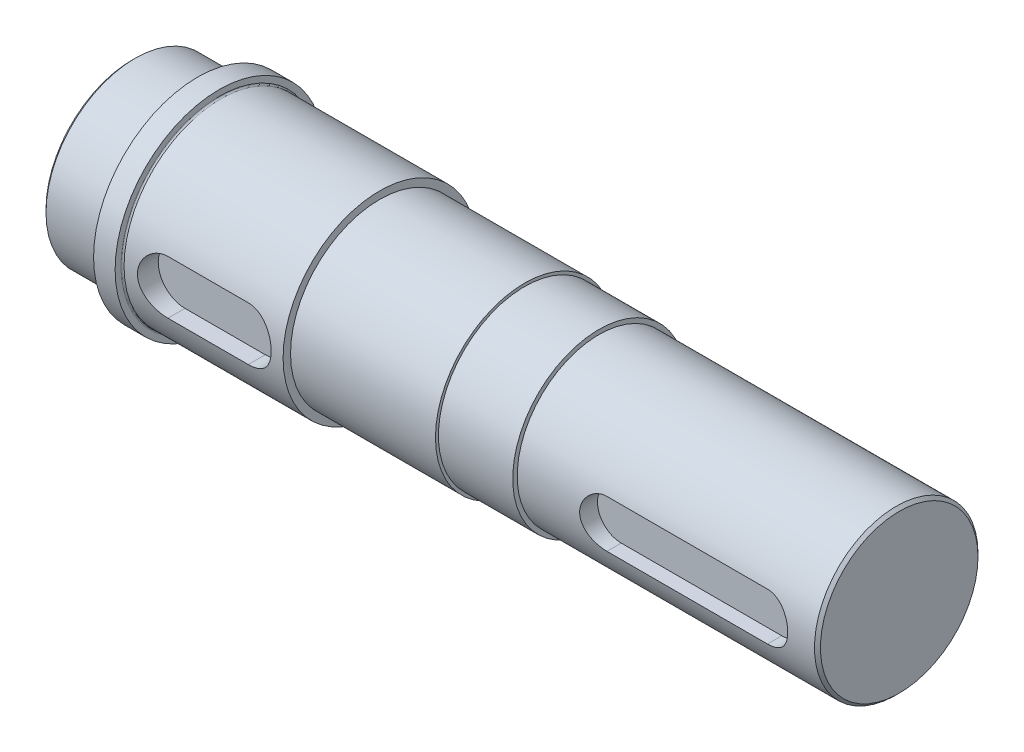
ISO-10303-21;
HEADER;
FILE_DESCRIPTION(('STEP AP214'),'2;1');
FILE_NAME('part.step','',(''),(''),'','','');
FILE_SCHEMA(('AUTOMOTIVE_DESIGN { 1 0 10303 214 1 1 1 1 }'));
ENDSEC;
DATA;
#1=APPLICATION_CONTEXT('core data for automotive mechanical design processes');
#2=APPLICATION_PROTOCOL_DEFINITION('international standard','automotive_design',2000,#1);
#3=PRODUCT_CONTEXT('',#1,'mechanical');
#4=PRODUCT('Part','Part','',(#3));
#5=PRODUCT_RELATED_PRODUCT_CATEGORY('part','',(#4));
#6=PRODUCT_DEFINITION_FORMATION('','',#4);
#7=PRODUCT_DEFINITION_CONTEXT('part definition',#1,'design');
#8=PRODUCT_DEFINITION('design','',#6,#7);
#9=PRODUCT_DEFINITION_SHAPE('','',#8);
#10=(LENGTH_UNIT() NAMED_UNIT(*) SI_UNIT(.MILLI.,.METRE.));
#11=(NAMED_UNIT(*) PLANE_ANGLE_UNIT() SI_UNIT($,.RADIAN.));
#12=(NAMED_UNIT(*) SI_UNIT($,.STERADIAN.) SOLID_ANGLE_UNIT());
#13=UNCERTAINTY_MEASURE_WITH_UNIT(LENGTH_MEASURE(1.E-05),#10,'distance_accuracy_value','');
#14=(GEOMETRIC_REPRESENTATION_CONTEXT(3) GLOBAL_UNCERTAINTY_ASSIGNED_CONTEXT((#13)) GLOBAL_UNIT_ASSIGNED_CONTEXT((#10,
#11,#12)) REPRESENTATION_CONTEXT('',''));
#15=CARTESIAN_POINT('',(0.,0.,0.));
#16=DIRECTION('',(0.,0.,1.));
#17=DIRECTION('',(1.,0.,0.));
#18=AXIS2_PLACEMENT_3D('',#15,#16,#17);
#19=CARTESIAN_POINT('',(22.,30.,0.));
#20=DIRECTION('',(-1.,0.,0.));
#21=DIRECTION('',(0.,0.,1.));
#22=AXIS2_PLACEMENT_3D('',#19,#20,#21);
#23=PLANE('',#22);
#24=CARTESIAN_POINT('',(22.,0.,0.));
#25=DIRECTION('',(1.,0.,0.));
#26=DIRECTION('',(0.,0.,-1.));
#27=AXIS2_PLACEMENT_3D('',#24,#25,#26);
#28=CIRCLE('',#27,35.);
#29=CARTESIAN_POINT('',(22.,0.,-35.));
#30=VERTEX_POINT('',#29);
#31=EDGE_CURVE('E177',#30,#30,#28,.T.);
#32=ORIENTED_EDGE('',*,*,#31,.F.);
#33=EDGE_LOOP('',(#32));
#34=FACE_BOUND('',#33,.T.);
#35=CARTESIAN_POINT('',(22.,0.,0.));
#36=DIRECTION('',(1.,0.,0.));
#37=DIRECTION('',(0.,0.,-1.));
#38=AXIS2_PLACEMENT_3D('',#35,#36,#37);
#39=CIRCLE('',#38,29.);
#40=CARTESIAN_POINT('',(22.,0.,-29.));
#41=VERTEX_POINT('',#40);
#42=EDGE_CURVE('E119',#41,#41,#39,.T.);
#43=ORIENTED_EDGE('',*,*,#42,.T.);
#44=EDGE_LOOP('',(#43));
#45=FACE_BOUND('',#44,.T.);
#46=ADVANCED_FACE('F32',(#34,#45),#23,.T.);
#47=CARTESIAN_POINT('',(277.09360796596,0.,0.));
#48=DIRECTION('',(1.,0.,0.));
#49=DIRECTION('',(0.,0.,-1.));
#50=AXIS2_PLACEMENT_3D('',#47,#48,#49);
#51=CYLINDRICAL_SURFACE('',#50,35.);
#52=ORIENTED_EDGE('',*,*,#31,.T.);
#53=EDGE_LOOP('',(#52));
#54=FACE_BOUND('',#53,.T.);
#55=CARTESIAN_POINT('',(29.25,0.,0.));
#56=DIRECTION('',(1.,0.,0.));
#57=DIRECTION('',(0.,0.,-1.));
#58=AXIS2_PLACEMENT_3D('',#55,#56,#57);
#59=CIRCLE('',#58,35.);
#60=CARTESIAN_POINT('',(29.25,0.,-35.));
#61=VERTEX_POINT('',#60);
#62=EDGE_CURVE('E174',#61,#61,#59,.T.);
#63=ORIENTED_EDGE('',*,*,#62,.F.);
#64=EDGE_LOOP('',(#63));
#65=FACE_BOUND('',#64,.T.);
#66=ADVANCED_FACE('F280',(#54,#65),#51,.T.);
#67=CARTESIAN_POINT('',(29.25,35.,0.));
#68=DIRECTION('',(1.,0.,0.));
#69=DIRECTION('',(0.,0.,-1.));
#70=AXIS2_PLACEMENT_3D('',#67,#68,#69);
#71=PLANE('',#70);
#72=CARTESIAN_POINT('',(29.25,0.,0.));
#73=DIRECTION('',(1.,0.,0.));
#74=DIRECTION('',(0.,0.,-1.));
#75=AXIS2_PLACEMENT_3D('',#72,#73,#74);
#76=CIRCLE('',#75,33.);
#77=CARTESIAN_POINT('',(29.25,0.,-33.));
#78=VERTEX_POINT('',#77);
#79=EDGE_CURVE('E11',#78,#78,#76,.F.);
#80=ORIENTED_EDGE('',*,*,#79,.T.);
#81=EDGE_LOOP('',(#80));
#82=FACE_BOUND('',#81,.T.);
#83=ORIENTED_EDGE('',*,*,#62,.T.);
#84=EDGE_LOOP('',(#83));
#85=FACE_BOUND('',#84,.T.);
#86=ADVANCED_FACE('F286',(#82,#85),#71,.T.);
#87=CARTESIAN_POINT('',(277.09360796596,0.,0.));
#88=DIRECTION('',(1.,0.,0.));
#89=DIRECTION('',(0.,0.,-1.));
#90=AXIS2_PLACEMENT_3D('',#87,#88,#89);
#91=CYLINDRICAL_SURFACE('',#90,32.5);
#92=CARTESIAN_POINT('',(29.75,0.,0.));
#93=DIRECTION('',(1.,0.,0.));
#94=DIRECTION('',(0.,0.,-1.));
#95=AXIS2_PLACEMENT_3D('',#92,#93,#94);
#96=CIRCLE('',#95,32.5);
#97=CARTESIAN_POINT('',(29.75,0.,-32.5));
#98=VERTEX_POINT('',#97);
#99=EDGE_CURVE('E40',#98,#98,#96,.T.);
#100=ORIENTED_EDGE('',*,*,#99,.T.);
#101=EDGE_LOOP('',(#100));
#102=FACE_BOUND('',#101,.T.);
#103=CARTESIAN_POINT('',(43.25,9.,31.2289929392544));
#104=CARTESIAN_POINT('',(43.0020813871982,9.00003254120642,31.228960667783));
#105=CARTESIAN_POINT('',(42.7541742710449,8.9897575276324,31.2319440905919));
#106=CARTESIAN_POINT('',(42.2602333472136,8.9488325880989,31.2437070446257));
#107=CARTESIAN_POINT('',(42.0141991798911,8.91818667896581,31.2524854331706));
#108=CARTESIAN_POINT('',(41.5263076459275,8.83685204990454,31.2755770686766));
#109=CARTESIAN_POINT('',(41.2844420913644,8.78620881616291,31.2898777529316));
#110=CARTESIAN_POINT('',(40.806021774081,8.66532381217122,31.3235713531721));
#111=CARTESIAN_POINT('',(40.5694671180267,8.59508164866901,31.3429643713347));
#112=CARTESIAN_POINT('',(40.1033981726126,8.43561126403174,31.3862592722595));
#113=CARTESIAN_POINT('',(39.8738807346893,8.3463916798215,31.4101591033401));
#114=CARTESIAN_POINT('',(39.4232009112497,8.1496068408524,31.461790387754));
#115=CARTESIAN_POINT('',(39.2020416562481,8.0420347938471,31.4895232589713));
#116=CARTESIAN_POINT('',(38.7695446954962,7.80934245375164,31.5480356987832));
#117=CARTESIAN_POINT('',(38.5582082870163,7.68421985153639,31.5788156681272));
#118=CARTESIAN_POINT('',(38.1466840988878,7.4172988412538,31.6425741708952));
#119=CARTESIAN_POINT('',(37.9464968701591,7.2754996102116,31.6755528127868));
#120=CARTESIAN_POINT('',(37.5537943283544,6.97253328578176,31.743636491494));
#121=CARTESIAN_POINT('',(37.361582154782,6.81098035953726,31.778773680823));
#122=CARTESIAN_POINT('',(36.9913584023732,6.47242834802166,31.8494516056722));
#123=CARTESIAN_POINT('',(36.8133470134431,6.29542905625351,31.8849923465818));
#124=CARTESIAN_POINT('',(36.4726431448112,5.92708884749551,31.9555124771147));
#125=CARTESIAN_POINT('',(36.3099533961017,5.73574538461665,31.9904917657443));
#126=CARTESIAN_POINT('',(36.0010165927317,5.33996801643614,32.0589311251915));
#127=CARTESIAN_POINT('',(35.8547690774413,5.13553447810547,32.0923912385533));
#128=CARTESIAN_POINT('',(35.5772992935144,4.71116323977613,32.1574535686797));
#129=CARTESIAN_POINT('',(35.4463876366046,4.49101563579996,32.189012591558));
#130=CARTESIAN_POINT('',(35.2036821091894,4.04008692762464,32.2487115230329));
#131=CARTESIAN_POINT('',(35.0918808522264,3.80930997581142,32.2768527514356));
#132=CARTESIAN_POINT('',(34.8882306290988,3.33864660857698,32.3289265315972));
#133=CARTESIAN_POINT('',(34.7963819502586,3.09876006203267,32.3528590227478));
#134=CARTESIAN_POINT('',(34.6334220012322,2.61161705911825,32.395821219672));
#135=CARTESIAN_POINT('',(34.5623101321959,2.36436081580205,32.4148510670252));
#136=CARTESIAN_POINT('',(34.4429426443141,1.87047796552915,32.4470497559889));
#137=CARTESIAN_POINT('',(34.3941679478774,1.62398540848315,32.4603512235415));
#138=CARTESIAN_POINT('',(34.3173794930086,1.12755153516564,32.4813845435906));
#139=CARTESIAN_POINT('',(34.2893654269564,0.877610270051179,32.4891164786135));
#140=CARTESIAN_POINT('',(34.2543541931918,0.37618194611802,32.4987901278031));
#141=CARTESIAN_POINT('',(34.2473541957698,0.124695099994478,32.5007326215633));
#142=CARTESIAN_POINT('',(34.2544276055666,-0.377957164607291,32.4987739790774));
#143=CARTESIAN_POINT('',(34.2685006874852,-0.629122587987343,32.4948729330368));
#144=CARTESIAN_POINT('',(34.3169161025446,-1.12237836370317,32.4815250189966));
#145=CARTESIAN_POINT('',(34.3506922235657,-1.36452874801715,32.4722331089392));
#146=CARTESIAN_POINT('',(34.43778192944,-1.84512110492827,32.4484735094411));
#147=CARTESIAN_POINT('',(34.4911025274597,-2.08356171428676,32.4340039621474));
#148=CARTESIAN_POINT('',(34.61682701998,-2.55496018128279,32.4002779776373));
#149=CARTESIAN_POINT('',(34.6892274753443,-2.78791901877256,32.3810224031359));
#150=CARTESIAN_POINT('',(34.8525443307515,-3.24685492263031,32.3382290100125));
#151=CARTESIAN_POINT('',(34.9434616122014,-3.4728316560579,32.3146909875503));
#152=CARTESIAN_POINT('',(35.1441660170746,-3.91865260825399,32.2636797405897));
#153=CARTESIAN_POINT('',(35.2541402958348,-4.13840813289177,32.2361679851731));
#154=CARTESIAN_POINT('',(35.4914869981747,-4.56789651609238,32.1781181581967));
#155=CARTESIAN_POINT('',(35.618859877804,-4.7776291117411,32.1475800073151));
#156=CARTESIAN_POINT('',(35.8901387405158,-5.1857978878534,32.0842666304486));
#157=CARTESIAN_POINT('',(36.034047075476,-5.38423245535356,32.0514910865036));
#158=CARTESIAN_POINT('',(36.3374356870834,-5.76856991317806,31.9845534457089));
#159=CARTESIAN_POINT('',(36.4969163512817,-5.95447249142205,31.9503913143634));
#160=CARTESIAN_POINT('',(36.835945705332,-6.31852809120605,31.8804279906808));
#161=CARTESIAN_POINT('',(37.0159827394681,-6.49622340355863,31.8446098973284));
#162=CARTESIAN_POINT('',(37.390417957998,-6.83587530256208,31.7734311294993));
#163=CARTESIAN_POINT('',(37.5848161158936,-6.99783191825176,31.7380704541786));
#164=CARTESIAN_POINT('',(37.9867861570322,-7.30496931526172,31.6687894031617));
#165=CARTESIAN_POINT('',(38.1943621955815,-7.45014476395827,31.6348694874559));
#166=CARTESIAN_POINT('',(38.6212795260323,-7.72263364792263,31.5694562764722));
#167=CARTESIAN_POINT('',(38.8406203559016,-7.84994778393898,31.5379628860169));
#168=CARTESIAN_POINT('',(39.291402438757,-8.08670686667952,31.4780909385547));
#169=CARTESIAN_POINT('',(39.5229255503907,-8.19600280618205,31.4497389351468));
#170=CARTESIAN_POINT('',(39.9947657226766,-8.39457780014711,31.3973185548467));
#171=CARTESIAN_POINT('',(40.2350791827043,-8.48386494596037,31.3732484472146));
#172=CARTESIAN_POINT('',(40.7226047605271,-8.64163454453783,31.3301586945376));
#173=CARTESIAN_POINT('',(40.9698094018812,-8.71013865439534,31.3111337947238));
#174=CARTESIAN_POINT('',(41.4694165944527,-8.82582765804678,31.2787206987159));
#175=CARTESIAN_POINT('',(41.7218166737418,-8.87302245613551,31.2653298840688));
#176=CARTESIAN_POINT('',(42.1868574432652,-8.93952721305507,31.2463738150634));
#177=CARTESIAN_POINT('',(42.3989843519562,-8.96220811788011,31.2398667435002));
#178=CARTESIAN_POINT('',(42.8240685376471,-8.99244047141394,31.2311713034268));
#179=CARTESIAN_POINT('',(43.0370240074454,-9.00001542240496,31.2289762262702));
#180=CARTESIAN_POINT('',(43.25,-9.,31.2289929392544));
#181=B_SPLINE_CURVE_WITH_KNOTS('',3,(#103,#104,#105,#106,#107,#108,#109,#110,#111,#112,#113,
#114,#115,#116,#117,#118,#119,#120,#121,#122,#123,#124,#125,#126,#127,#128,#129,#130,#131,#132,
#133,#134,#135,#136,#137,#138,#139,#140,#141,#142,#143,#144,#145,#146,#147,#148,#149,#150,#151,
#152,#153,#154,#155,#156,#157,#158,#159,#160,#161,#162,#163,#164,#165,#166,#167,#168,#169,#170,
#171,#172,#173,#174,#175,#176,#177,#178,#179,#180),.UNSPECIFIED.,.F.,.F.,(4,2,2,2,2,2,2,2,2,2,2,
2,2,2,2,2,2,2,2,2,2,2,2,2,2,2,2,2,2,2,2,2,2,2,2,2,2,2,4),(0.,0.743507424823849,1.48686828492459,
2.22854793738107,2.97024247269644,3.71160017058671,4.45323284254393,5.19496318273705,
5.93673014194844,6.69645817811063,7.45619637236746,8.21606973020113,8.97592179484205,
9.74917985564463,10.5221383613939,11.2951079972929,12.0680553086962,12.8219941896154,
13.5759218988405,14.3297480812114,15.0835626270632,15.8167130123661,16.5501267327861,
17.2834083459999,18.0167248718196,18.7576999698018,19.4986944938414,20.2397945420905,
20.9809130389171,21.7464708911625,22.5120273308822,23.2778263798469,24.0435953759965,
24.8154099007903,25.5869117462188,26.3576068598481,27.1279433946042,27.7676829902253,
28.406426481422),.UNSPECIFIED.);
#182=CARTESIAN_POINT('',(43.25,9.,31.2289929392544));
#183=VERTEX_POINT('',#182);
#184=CARTESIAN_POINT('',(43.25,-9.,31.2289929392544));
#185=VERTEX_POINT('',#184);
#186=EDGE_CURVE('E232',#183,#185,#181,.T.);
#187=ORIENTED_EDGE('',*,*,#186,.F.);
#188=DIRECTION('',(1.,0.,0.));
#189=VECTOR('',#188,1.);
#190=CARTESIAN_POINT('',(277.09360796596,8.99999999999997,31.2289929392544));
#191=LINE('',#190,#189);
#192=CARTESIAN_POINT('',(70.25,9.,31.2289929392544));
#193=VERTEX_POINT('',#192);
#194=EDGE_CURVE('E263',#193,#183,#191,.F.);
#195=ORIENTED_EDGE('',*,*,#194,.F.);
#196=CARTESIAN_POINT('',(70.25,-9.,31.2289929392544));
#197=CARTESIAN_POINT('',(70.4979186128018,-9.00003254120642,31.228960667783));
#198=CARTESIAN_POINT('',(70.7458257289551,-8.9897575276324,31.2319440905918));
#199=CARTESIAN_POINT('',(71.2397666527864,-8.94883258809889,31.2437070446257));
#200=CARTESIAN_POINT('',(71.4858008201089,-8.91818667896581,31.2524854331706));
#201=CARTESIAN_POINT('',(71.9736923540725,-8.83685204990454,31.2755770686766));
#202=CARTESIAN_POINT('',(72.2155579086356,-8.7862088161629,31.2898777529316));
#203=CARTESIAN_POINT('',(72.693978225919,-8.66532381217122,31.3235713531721));
#204=CARTESIAN_POINT('',(72.9305328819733,-8.59508164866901,31.3429643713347));
#205=CARTESIAN_POINT('',(73.3966018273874,-8.43561126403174,31.3862592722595));
#206=CARTESIAN_POINT('',(73.6261192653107,-8.3463916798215,31.4101591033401));
#207=CARTESIAN_POINT('',(74.0767990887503,-8.1496068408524,31.461790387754));
#208=CARTESIAN_POINT('',(74.2979583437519,-8.0420347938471,31.4895232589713));
#209=CARTESIAN_POINT('',(74.7304553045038,-7.80934245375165,31.5480356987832));
#210=CARTESIAN_POINT('',(74.9417917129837,-7.6842198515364,31.5788156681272));
#211=CARTESIAN_POINT('',(75.3533159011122,-7.41729884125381,31.6425741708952));
#212=CARTESIAN_POINT('',(75.5535031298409,-7.27549961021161,31.6755528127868));
#213=CARTESIAN_POINT('',(75.9462056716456,-6.97253328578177,31.743636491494));
#214=CARTESIAN_POINT('',(76.138417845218,-6.81098035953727,31.778773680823));
#215=CARTESIAN_POINT('',(76.5086415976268,-6.47242834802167,31.8494516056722));
#216=CARTESIAN_POINT('',(76.6866529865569,-6.29542905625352,31.8849923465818));
#217=CARTESIAN_POINT('',(77.0273568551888,-5.92708884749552,31.9555124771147));
#218=CARTESIAN_POINT('',(77.1900466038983,-5.73574538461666,31.9904917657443));
#219=CARTESIAN_POINT('',(77.4989834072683,-5.33996801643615,32.0589311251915));
#220=CARTESIAN_POINT('',(77.6452309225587,-5.13553447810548,32.0923912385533));
#221=CARTESIAN_POINT('',(77.9227007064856,-4.71116323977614,32.1574535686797));
#222=CARTESIAN_POINT('',(78.0536123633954,-4.49101563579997,32.189012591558));
#223=CARTESIAN_POINT('',(78.2963178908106,-4.04008692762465,32.2487115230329));
#224=CARTESIAN_POINT('',(78.4081191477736,-3.80930997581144,32.2768527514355));
#225=CARTESIAN_POINT('',(78.6117693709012,-3.33864660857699,32.3289265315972));
#226=CARTESIAN_POINT('',(78.7036180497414,-3.09876006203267,32.3528590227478));
#227=CARTESIAN_POINT('',(78.8665779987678,-2.61161705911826,32.395821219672));
#228=CARTESIAN_POINT('',(78.9376898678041,-2.36436081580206,32.4148510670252));
#229=CARTESIAN_POINT('',(79.0570573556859,-1.87047796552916,32.4470497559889));
#230=CARTESIAN_POINT('',(79.1058320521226,-1.62398540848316,32.4603512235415));
#231=CARTESIAN_POINT('',(79.1826205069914,-1.12755153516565,32.4813845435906));
#232=CARTESIAN_POINT('',(79.2106345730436,-0.87761027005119,32.4891164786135));
#233=CARTESIAN_POINT('',(79.2456458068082,-0.376181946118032,32.4987901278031));
#234=CARTESIAN_POINT('',(79.2526458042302,-0.124695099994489,32.5007326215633));
#235=CARTESIAN_POINT('',(79.2455723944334,0.377957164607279,32.4987739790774));
#236=CARTESIAN_POINT('',(79.2314993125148,0.629122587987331,32.4948729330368));
#237=CARTESIAN_POINT('',(79.1830838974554,1.12237836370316,32.4815250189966));
#238=CARTESIAN_POINT('',(79.1493077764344,1.36452874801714,32.4722331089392));
#239=CARTESIAN_POINT('',(79.06221807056,1.84512110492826,32.4484735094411));
#240=CARTESIAN_POINT('',(79.0088974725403,2.08356171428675,32.4340039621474));
#241=CARTESIAN_POINT('',(78.88317298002,2.55496018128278,32.4002779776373));
#242=CARTESIAN_POINT('',(78.8107725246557,2.78791901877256,32.3810224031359));
#243=CARTESIAN_POINT('',(78.6474556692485,3.2468549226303,32.3382290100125));
#244=CARTESIAN_POINT('',(78.5565383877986,3.47283165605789,32.3146909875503));
#245=CARTESIAN_POINT('',(78.3558339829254,3.91865260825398,32.2636797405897));
#246=CARTESIAN_POINT('',(78.2458597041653,4.13840813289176,32.2361679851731));
#247=CARTESIAN_POINT('',(78.0085130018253,4.56789651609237,32.1781181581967));
#248=CARTESIAN_POINT('',(77.881140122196,4.7776291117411,32.1475800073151));
#249=CARTESIAN_POINT('',(77.6098612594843,5.18579788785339,32.0842666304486));
#250=CARTESIAN_POINT('',(77.465952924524,5.38423245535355,32.0514910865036));
#251=CARTESIAN_POINT('',(77.1625643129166,5.76856991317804,31.9845534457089));
#252=CARTESIAN_POINT('',(77.0030836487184,5.95447249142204,31.9503913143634));
#253=CARTESIAN_POINT('',(76.664054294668,6.31852809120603,31.8804279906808));
#254=CARTESIAN_POINT('',(76.4840172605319,6.49622340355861,31.8446098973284));
#255=CARTESIAN_POINT('',(76.109582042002,6.83587530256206,31.7734311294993));
#256=CARTESIAN_POINT('',(75.9151838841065,6.99783191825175,31.7380704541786));
#257=CARTESIAN_POINT('',(75.5132138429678,7.30496931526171,31.6687894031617));
#258=CARTESIAN_POINT('',(75.3056378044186,7.45014476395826,31.6348694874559));
#259=CARTESIAN_POINT('',(74.8787204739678,7.72263364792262,31.5694562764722));
#260=CARTESIAN_POINT('',(74.6593796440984,7.84994778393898,31.5379628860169));
#261=CARTESIAN_POINT('',(74.208597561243,8.08670686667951,31.4780909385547));
#262=CARTESIAN_POINT('',(73.9770744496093,8.19600280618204,31.4497389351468));
#263=CARTESIAN_POINT('',(73.5052342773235,8.3945778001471,31.3973185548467));
#264=CARTESIAN_POINT('',(73.2649208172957,8.48386494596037,31.3732484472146));
#265=CARTESIAN_POINT('',(72.7773952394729,8.64163454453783,31.3301586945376));
#266=CARTESIAN_POINT('',(72.5301905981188,8.71013865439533,31.3111337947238));
#267=CARTESIAN_POINT('',(72.0305834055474,8.82582765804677,31.2787206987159));
#268=CARTESIAN_POINT('',(71.7781833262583,8.8730224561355,31.2653298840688));
#269=CARTESIAN_POINT('',(71.3131425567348,8.93952721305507,31.2463738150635));
#270=CARTESIAN_POINT('',(71.1010156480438,8.9622081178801,31.2398667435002));
#271=CARTESIAN_POINT('',(70.6759314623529,8.99244047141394,31.2311713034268));
#272=CARTESIAN_POINT('',(70.4629759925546,9.00001542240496,31.2289762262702));
#273=CARTESIAN_POINT('',(70.25,9.,31.2289929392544));
#274=B_SPLINE_CURVE_WITH_KNOTS('',3,(#196,#197,#198,#199,#200,#201,#202,#203,#204,#205,#206,
#207,#208,#209,#210,#211,#212,#213,#214,#215,#216,#217,#218,#219,#220,#221,#222,#223,#224,#225,
#226,#227,#228,#229,#230,#231,#232,#233,#234,#235,#236,#237,#238,#239,#240,#241,#242,#243,#244,
#245,#246,#247,#248,#249,#250,#251,#252,#253,#254,#255,#256,#257,#258,#259,#260,#261,#262,#263,
#264,#265,#266,#267,#268,#269,#270,#271,#272,#273),.UNSPECIFIED.,.F.,.F.,(4,2,2,2,2,2,2,2,2,2,2,
2,2,2,2,2,2,2,2,2,2,2,2,2,2,2,2,2,2,2,2,2,2,2,2,2,2,2,4),(0.,0.743507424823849,1.48686828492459,
2.22854793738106,2.97024247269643,3.71160017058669,4.4532328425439,5.19496318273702,
5.93673014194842,6.69645817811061,7.45619637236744,8.2160697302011,8.97592179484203,
9.74917985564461,10.5221383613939,11.2951079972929,12.0680553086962,12.8219941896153,
13.5759218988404,14.3297480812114,15.0835626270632,15.8167130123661,16.5501267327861,
17.2834083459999,18.0167248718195,18.7576999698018,19.4986944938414,20.2397945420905,
20.9809130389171,21.7464708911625,22.5120273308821,23.2778263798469,24.0435953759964,
24.8154099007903,25.5869117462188,26.3576068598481,27.1279433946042,27.7676829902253,
28.406426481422),.UNSPECIFIED.);
#275=CARTESIAN_POINT('',(70.25,-9.,31.2289929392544));
#276=VERTEX_POINT('',#275);
#277=EDGE_CURVE('E103',#276,#193,#274,.T.);
#278=ORIENTED_EDGE('',*,*,#277,.F.);
#279=DIRECTION('',(1.,0.,0.));
#280=VECTOR('',#279,1.);
#281=CARTESIAN_POINT('',(277.09360796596,-8.99999999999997,31.2289929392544));
#282=LINE('',#281,#280);
#283=EDGE_CURVE('E240',#185,#276,#282,.T.);
#284=ORIENTED_EDGE('',*,*,#283,.F.);
#285=EDGE_LOOP('',(#187,#195,#278,#284));
#286=FACE_BOUND('',#285,.T.);
#287=CARTESIAN_POINT('',(83.25,0.,0.));
#288=DIRECTION('',(1.,0.,0.));
#289=DIRECTION('',(0.,0.,-1.));
#290=AXIS2_PLACEMENT_3D('',#287,#288,#289);
#291=CIRCLE('',#290,32.5);
#292=CARTESIAN_POINT('',(83.25,0.,-32.5));
#293=VERTEX_POINT('',#292);
#294=EDGE_CURVE('E171',#293,#293,#291,.T.);
#295=ORIENTED_EDGE('',*,*,#294,.F.);
#296=EDGE_LOOP('',(#295));
#297=FACE_BOUND('',#296,.T.);
#298=ADVANCED_FACE('F242',(#102,#286,#297),#91,.T.);
#299=CARTESIAN_POINT('',(83.25,32.5,0.));
#300=DIRECTION('',(1.,0.,0.));
#301=DIRECTION('',(0.,0.,-1.));
#302=AXIS2_PLACEMENT_3D('',#299,#300,#301);
#303=PLANE('',#302);
#304=ORIENTED_EDGE('',*,*,#294,.T.);
#305=EDGE_LOOP('',(#304));
#306=FACE_BOUND('',#305,.T.);
#307=CARTESIAN_POINT('',(83.25,0.,0.));
#308=DIRECTION('',(1.,0.,0.));
#309=DIRECTION('',(0.,0.,-1.));
#310=AXIS2_PLACEMENT_3D('',#307,#308,#309);
#311=CIRCLE('',#310,30.);
#312=CARTESIAN_POINT('',(83.25,0.,-30.));
#313=VERTEX_POINT('',#312);
#314=EDGE_CURVE('E168',#313,#313,#311,.T.);
#315=ORIENTED_EDGE('',*,*,#314,.F.);
#316=EDGE_LOOP('',(#315));
#317=FACE_BOUND('',#316,.T.);
#318=ADVANCED_FACE('F339',(#306,#317),#303,.T.);
#319=CARTESIAN_POINT('',(277.09360796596,0.,0.));
#320=DIRECTION('',(1.,0.,0.));
#321=DIRECTION('',(0.,0.,-1.));
#322=AXIS2_PLACEMENT_3D('',#319,#320,#321);
#323=CYLINDRICAL_SURFACE('',#322,30.);
#324=ORIENTED_EDGE('',*,*,#314,.T.);
#325=EDGE_LOOP('',(#324));
#326=FACE_BOUND('',#325,.T.);
#327=CARTESIAN_POINT('',(132.,0.,0.));
#328=DIRECTION('',(1.,0.,0.));
#329=DIRECTION('',(0.,0.,-1.));
#330=AXIS2_PLACEMENT_3D('',#327,#328,#329);
#331=CIRCLE('',#330,30.);
#332=CARTESIAN_POINT('',(132.,0.,-30.));
#333=VERTEX_POINT('',#332);
#334=EDGE_CURVE('E165',#333,#333,#331,.T.);
#335=ORIENTED_EDGE('',*,*,#334,.F.);
#336=EDGE_LOOP('',(#335));
#337=FACE_BOUND('',#336,.T.);
#338=ADVANCED_FACE('F467',(#326,#337),#323,.T.);
#339=CARTESIAN_POINT('',(132.,30.,0.));
#340=DIRECTION('',(1.,0.,0.));
#341=DIRECTION('',(0.,0.,-1.));
#342=AXIS2_PLACEMENT_3D('',#339,#340,#341);
#343=PLANE('',#342);
#344=ORIENTED_EDGE('',*,*,#334,.T.);
#345=EDGE_LOOP('',(#344));
#346=FACE_BOUND('',#345,.T.);
#347=CARTESIAN_POINT('',(132.,0.,0.));
#348=DIRECTION('',(1.,0.,0.));
#349=DIRECTION('',(0.,0.,-1.));
#350=AXIS2_PLACEMENT_3D('',#347,#348,#349);
#351=CIRCLE('',#350,29.);
#352=CARTESIAN_POINT('',(132.,0.,-29.));
#353=VERTEX_POINT('',#352);
#354=EDGE_CURVE('E162',#353,#353,#351,.T.);
#355=ORIENTED_EDGE('',*,*,#354,.F.);
#356=EDGE_LOOP('',(#355));
#357=FACE_BOUND('',#356,.T.);
#358=ADVANCED_FACE('F458',(#346,#357),#343,.T.);
#359=CARTESIAN_POINT('',(277.09360796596,0.,0.));
#360=DIRECTION('',(1.,0.,0.));
#361=DIRECTION('',(0.,0.,-1.));
#362=AXIS2_PLACEMENT_3D('',#359,#360,#361);
#363=CYLINDRICAL_SURFACE('',#362,29.);
#364=ORIENTED_EDGE('',*,*,#354,.T.);
#365=EDGE_LOOP('',(#364));
#366=FACE_BOUND('',#365,.T.);
#367=CARTESIAN_POINT('',(157.,0.,0.));
#368=DIRECTION('',(1.,0.,0.));
#369=DIRECTION('',(0.,0.,-1.));
#370=AXIS2_PLACEMENT_3D('',#367,#368,#369);
#371=CIRCLE('',#370,29.);
#372=CARTESIAN_POINT('',(157.,0.,-29.));
#373=VERTEX_POINT('',#372);
#374=EDGE_CURVE('E159',#373,#373,#371,.T.);
#375=ORIENTED_EDGE('',*,*,#374,.F.);
#376=EDGE_LOOP('',(#375));
#377=FACE_BOUND('',#376,.T.);
#378=ADVANCED_FACE('F450',(#366,#377),#363,.T.);
#379=CARTESIAN_POINT('',(157.,29.,0.));
#380=DIRECTION('',(1.,0.,0.));
#381=DIRECTION('',(0.,0.,-1.));
#382=AXIS2_PLACEMENT_3D('',#379,#380,#381);
#383=PLANE('',#382);
#384=ORIENTED_EDGE('',*,*,#374,.T.);
#385=EDGE_LOOP('',(#384));
#386=FACE_BOUND('',#385,.T.);
#387=CARTESIAN_POINT('',(157.,0.,0.));
#388=DIRECTION('',(1.,0.,0.));
#389=DIRECTION('',(0.,0.,-1.));
#390=AXIS2_PLACEMENT_3D('',#387,#388,#389);
#391=CIRCLE('',#390,27.5);
#392=CARTESIAN_POINT('',(157.,0.,-27.5));
#393=VERTEX_POINT('',#392);
#394=EDGE_CURVE('E149',#393,#393,#391,.T.);
#395=ORIENTED_EDGE('',*,*,#394,.F.);
#396=EDGE_LOOP('',(#395));
#397=FACE_BOUND('',#396,.T.);
#398=ADVANCED_FACE('F442',(#386,#397),#383,.T.);
#399=CARTESIAN_POINT('',(277.09360796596,0.,0.));
#400=DIRECTION('',(1.,0.,0.));
#401=DIRECTION('',(0.,0.,-1.));
#402=AXIS2_PLACEMENT_3D('',#399,#400,#401);
#403=CYLINDRICAL_SURFACE('',#402,27.5);
#404=CARTESIAN_POINT('',(186.,7.99999999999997,26.3106442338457));
#405=CARTESIAN_POINT('',(185.780113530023,8.00002941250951,26.3106138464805));
#406=CARTESIAN_POINT('',(185.560238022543,7.99093569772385,26.31339970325));
#407=CARTESIAN_POINT('',(185.122158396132,7.95471953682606,26.3243821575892));
#408=CARTESIAN_POINT('',(184.903953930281,7.92760094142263,26.3325775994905));
#409=CARTESIAN_POINT('',(184.471295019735,7.85563960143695,26.3541315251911));
#410=CARTESIAN_POINT('',(184.256832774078,7.81083993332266,26.3674774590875));
#411=CARTESIAN_POINT('',(183.832626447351,7.70391661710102,26.3989164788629));
#412=CARTESIAN_POINT('',(183.622882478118,7.64179255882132,26.4170096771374));
#413=CARTESIAN_POINT('',(183.209657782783,7.50077525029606,26.4573947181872));
#414=CARTESIAN_POINT('',(183.006173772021,7.4218909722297,26.4796843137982));
#415=CARTESIAN_POINT('',(182.606605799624,7.24792208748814,26.5278301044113));
#416=CARTESIAN_POINT('',(182.410524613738,7.15283147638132,26.5536876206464));
#417=CARTESIAN_POINT('',(182.02703718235,6.9471518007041,26.6082392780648));
#418=CARTESIAN_POINT('',(181.839632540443,6.83655988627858,26.63693394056));
#419=CARTESIAN_POINT('',(181.47466776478,6.60065041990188,26.6963706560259));
#420=CARTESIAN_POINT('',(181.297108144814,6.47533210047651,26.7271128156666));
#421=CARTESIAN_POINT('',(180.948292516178,6.2072475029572,26.7906616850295));
#422=CARTESIAN_POINT('',(180.77733231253,6.06410407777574,26.8235016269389));
#423=CARTESIAN_POINT('',(180.447988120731,5.76409444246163,26.8895667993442));
#424=CARTESIAN_POINT('',(180.289604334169,5.60722801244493,26.9227920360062));
#425=CARTESIAN_POINT('',(179.986396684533,5.2807400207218,26.9887294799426));
#426=CARTESIAN_POINT('',(179.841575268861,5.11111616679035,27.0214415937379));
#427=CARTESIAN_POINT('',(179.566485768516,4.76020963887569,27.0854611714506));
#428=CARTESIAN_POINT('',(179.436217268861,4.57892729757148,27.1167686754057));
#429=CARTESIAN_POINT('',(179.188726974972,4.20218325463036,27.1777256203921));
#430=CARTESIAN_POINT('',(179.071810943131,4.00651327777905,27.2073305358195));
#431=CARTESIAN_POINT('',(178.854975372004,3.60562548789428,27.2633528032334));
#432=CARTESIAN_POINT('',(178.755049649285,3.4004111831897,27.2897713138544));
#433=CARTESIAN_POINT('',(178.57295513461,2.98179504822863,27.3386777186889));
#434=CARTESIAN_POINT('',(178.490786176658,2.76839329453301,27.3611656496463));
#435=CARTESIAN_POINT('',(178.344916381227,2.33494709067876,27.4015581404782));
#436=CARTESIAN_POINT('',(178.281214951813,2.11490285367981,27.4194628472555));
#437=CARTESIAN_POINT('',(178.174320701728,1.67583141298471,27.4497486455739));
#438=CARTESIAN_POINT('',(178.130620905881,1.45693695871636,27.4622657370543));
#439=CARTESIAN_POINT('',(178.061646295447,1.01603367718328,27.4821099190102));
#440=CARTESIAN_POINT('',(178.036370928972,0.794024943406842,27.4894371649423));
#441=CARTESIAN_POINT('',(178.004480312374,0.34859087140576,27.4986927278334));
#442=CARTESIAN_POINT('',(177.997862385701,0.125165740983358,27.5006218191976));
#443=CARTESIAN_POINT('',(178.003341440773,-0.321433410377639,27.4990279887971));
#444=CARTESIAN_POINT('',(178.015438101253,-0.544607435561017,27.4955051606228));
#445=CARTESIAN_POINT('',(178.057584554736,-0.982297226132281,27.4832962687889));
#446=CARTESIAN_POINT('',(178.087081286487,-1.19687096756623,27.4747693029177));
#447=CARTESIAN_POINT('',(178.163324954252,-1.62275603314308,27.4529077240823));
#448=CARTESIAN_POINT('',(178.210077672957,-1.83406623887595,27.439571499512));
#449=CARTESIAN_POINT('',(178.320421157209,-2.25182822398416,27.4084500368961));
#450=CARTESIAN_POINT('',(178.384006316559,-2.45828159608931,27.39066628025));
#451=CARTESIAN_POINT('',(178.527537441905,-2.86510907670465,27.351104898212));
#452=CARTESIAN_POINT('',(178.607489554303,-3.06548086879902,27.3293257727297));
#453=CARTESIAN_POINT('',(178.784082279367,-3.46091415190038,27.2820848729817));
#454=CARTESIAN_POINT('',(178.880894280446,-3.65589461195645,27.256585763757));
#455=CARTESIAN_POINT('',(179.089920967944,-4.03708759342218,27.2027387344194));
#456=CARTESIAN_POINT('',(179.202140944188,-4.22329707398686,27.1743898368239));
#457=CARTESIAN_POINT('',(179.441180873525,-4.58574078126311,27.1155802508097));
#458=CARTESIAN_POINT('',(179.568000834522,-4.7619750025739,27.0851195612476));
#459=CARTESIAN_POINT('',(179.835411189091,-5.10341760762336,27.0228653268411));
#460=CARTESIAN_POINT('',(179.97600195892,-5.26862568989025,26.991071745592));
#461=CARTESIAN_POINT('',(180.275438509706,-5.59283881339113,26.9257959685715));
#462=CARTESIAN_POINT('',(180.434762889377,-5.75139827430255,26.892294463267));
#463=CARTESIAN_POINT('',(180.766170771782,-6.05453947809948,26.8256711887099));
#464=CARTESIAN_POINT('',(180.938250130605,-6.19912572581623,26.7925493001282));
#465=CARTESIAN_POINT('',(181.294236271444,-6.47350928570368,26.7275807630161));
#466=CARTESIAN_POINT('',(181.478150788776,-6.60329676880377,26.6957349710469));
#467=CARTESIAN_POINT('',(181.856453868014,-6.84701637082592,26.6342666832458));
#468=CARTESIAN_POINT('',(182.050838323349,-6.96095464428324,26.6046433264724));
#469=CARTESIAN_POINT('',(182.450775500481,-7.17319581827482,26.5482097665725));
#470=CARTESIAN_POINT('',(182.656416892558,-7.27133962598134,26.5214290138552));
#471=CARTESIAN_POINT('',(183.075650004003,-7.44983609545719,26.4718440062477));
#472=CARTESIAN_POINT('',(183.28923844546,-7.53019599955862,26.4490381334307));
#473=CARTESIAN_POINT('',(183.722682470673,-7.67240466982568,26.408136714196));
#474=CARTESIAN_POINT('',(183.942531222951,-7.73427282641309,26.3900362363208));
#475=CARTESIAN_POINT('',(184.386977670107,-7.83902146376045,26.3591107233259));
#476=CARTESIAN_POINT('',(184.611573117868,-7.88191072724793,26.3462832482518));
#477=CARTESIAN_POINT('',(185.030074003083,-7.94336457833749,26.3278154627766));
#478=CARTESIAN_POINT('',(185.223556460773,-7.96460439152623,26.3213881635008));
#479=CARTESIAN_POINT('',(185.611354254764,-7.99291944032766,26.312796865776));
#480=CARTESIAN_POINT('',(185.805667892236,-8.00001601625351,26.3106264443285));
#481=CARTESIAN_POINT('',(186.,-8.,26.3106442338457));
#482=B_SPLINE_CURVE_WITH_KNOTS('',3,(#404,#405,#406,#407,#408,#409,#410,#411,#412,#413,#414,
#415,#416,#417,#418,#419,#420,#421,#422,#423,#424,#425,#426,#427,#428,#429,#430,#431,#432,#433,
#434,#435,#436,#437,#438,#439,#440,#441,#442,#443,#444,#445,#446,#447,#448,#449,#450,#451,#452,
#453,#454,#455,#456,#457,#458,#459,#460,#461,#462,#463,#464,#465,#466,#467,#468,#469,#470,#471,
#472,#473,#474,#475,#476,#477,#478,#479,#480,#481),.UNSPECIFIED.,.F.,.F.,(4,2,2,2,2,2,2,2,2,2,2,
2,2,2,2,2,2,2,2,2,2,2,2,2,2,2,2,2,2,2,2,2,2,2,2,2,2,2,4),(0.,0.659436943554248,1.31873305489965,
1.97643273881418,2.63414799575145,3.29151204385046,3.94912017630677,4.60684936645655,
5.26461284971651,5.93997685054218,6.61535167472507,7.29084813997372,7.96632533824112,
8.65504200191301,9.34350747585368,10.0319665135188,10.7204034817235,11.3902655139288,
12.0601074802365,12.729853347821,13.3995877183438,14.0491017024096,14.6988335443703,
15.348349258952,15.9981093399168,16.6549076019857,17.311931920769,17.9689565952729,
18.6259992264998,19.3069904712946,19.9877614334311,20.6689819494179,21.3499371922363,
22.0373719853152,22.72452630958,23.4109575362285,24.0970707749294,24.6807726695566,
25.2635931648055),.UNSPECIFIED.);
#483=CARTESIAN_POINT('',(186.,7.99999999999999,26.3106442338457));
#484=VERTEX_POINT('',#483);
#485=CARTESIAN_POINT('',(186.,-8.,26.3106442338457));
#486=VERTEX_POINT('',#485);
#487=EDGE_CURVE('E192',#484,#486,#482,.T.);
#488=ORIENTED_EDGE('',*,*,#487,.F.);
#489=DIRECTION('',(1.,0.,0.));
#490=VECTOR('',#489,1.);
#491=CARTESIAN_POINT('',(277.09360796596,8.,26.3106442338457));
#492=LINE('',#491,#490);
#493=CARTESIAN_POINT('',(240.,7.99999999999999,26.3106442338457));
#494=VERTEX_POINT('',#493);
#495=EDGE_CURVE('E230',#494,#484,#492,.F.);
#496=ORIENTED_EDGE('',*,*,#495,.F.);
#497=CARTESIAN_POINT('',(240.,-8.,26.3106442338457));
#498=CARTESIAN_POINT('',(240.219886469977,-8.00002941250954,26.3106138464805));
#499=CARTESIAN_POINT('',(240.439761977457,-7.99093569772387,26.31339970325));
#500=CARTESIAN_POINT('',(240.877841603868,-7.95471953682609,26.3243821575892));
#501=CARTESIAN_POINT('',(241.096046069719,-7.92760094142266,26.3325775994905));
#502=CARTESIAN_POINT('',(241.528704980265,-7.85563960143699,26.3541315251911));
#503=CARTESIAN_POINT('',(241.743167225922,-7.8108399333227,26.3674774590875));
#504=CARTESIAN_POINT('',(242.167373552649,-7.70391661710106,26.3989164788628));
#505=CARTESIAN_POINT('',(242.377117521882,-7.64179255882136,26.4170096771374));
#506=CARTESIAN_POINT('',(242.790342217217,-7.50077525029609,26.4573947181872));
#507=CARTESIAN_POINT('',(242.993826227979,-7.42189097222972,26.4796843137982));
#508=CARTESIAN_POINT('',(243.393394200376,-7.24792208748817,26.5278301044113));
#509=CARTESIAN_POINT('',(243.589475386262,-7.15283147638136,26.5536876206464));
#510=CARTESIAN_POINT('',(243.97296281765,-6.94715180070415,26.6082392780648));
#511=CARTESIAN_POINT('',(244.160367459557,-6.83655988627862,26.63693394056));
#512=CARTESIAN_POINT('',(244.52533223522,-6.60065041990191,26.6963706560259));
#513=CARTESIAN_POINT('',(244.702891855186,-6.47533210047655,26.7271128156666));
#514=CARTESIAN_POINT('',(245.051707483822,-6.20724750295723,26.7906616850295));
#515=CARTESIAN_POINT('',(245.22266768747,-6.06410407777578,26.8235016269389));
#516=CARTESIAN_POINT('',(245.552011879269,-5.76409444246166,26.8895667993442));
#517=CARTESIAN_POINT('',(245.710395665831,-5.60722801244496,26.9227920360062));
#518=CARTESIAN_POINT('',(246.013603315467,-5.28074002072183,26.9887294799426));
#519=CARTESIAN_POINT('',(246.158424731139,-5.11111616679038,27.0214415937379));
#520=CARTESIAN_POINT('',(246.433514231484,-4.76020963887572,27.0854611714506));
#521=CARTESIAN_POINT('',(246.563782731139,-4.57892729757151,27.1167686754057));
#522=CARTESIAN_POINT('',(246.811273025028,-4.20218325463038,27.1777256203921));
#523=CARTESIAN_POINT('',(246.928189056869,-4.00651327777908,27.2073305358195));
#524=CARTESIAN_POINT('',(247.145024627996,-3.6056254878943,27.2633528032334));
#525=CARTESIAN_POINT('',(247.244950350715,-3.40041118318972,27.2897713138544));
#526=CARTESIAN_POINT('',(247.42704486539,-2.98179504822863,27.3386777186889));
#527=CARTESIAN_POINT('',(247.509213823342,-2.768393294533,27.3611656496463));
#528=CARTESIAN_POINT('',(247.655083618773,-2.33494709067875,27.4015581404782));
#529=CARTESIAN_POINT('',(247.718785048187,-2.1149028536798,27.4194628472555));
#530=CARTESIAN_POINT('',(247.825679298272,-1.67583141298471,27.4497486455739));
#531=CARTESIAN_POINT('',(247.869379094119,-1.45693695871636,27.4622657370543));
#532=CARTESIAN_POINT('',(247.938353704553,-1.01603367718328,27.4821099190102));
#533=CARTESIAN_POINT('',(247.963629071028,-0.794024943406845,27.4894371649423));
#534=CARTESIAN_POINT('',(247.995519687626,-0.34859087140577,27.4986927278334));
#535=CARTESIAN_POINT('',(248.002137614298,-0.125165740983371,27.5006218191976));
#536=CARTESIAN_POINT('',(247.996658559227,0.321433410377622,27.4990279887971));
#537=CARTESIAN_POINT('',(247.984561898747,0.544607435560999,27.4955051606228));
#538=CARTESIAN_POINT('',(247.942415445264,0.982297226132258,27.4832962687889));
#539=CARTESIAN_POINT('',(247.912918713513,1.19687096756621,27.4747693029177));
#540=CARTESIAN_POINT('',(247.836675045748,1.62275603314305,27.4529077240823));
#541=CARTESIAN_POINT('',(247.789922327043,1.83406623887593,27.439571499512));
#542=CARTESIAN_POINT('',(247.679578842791,2.25182822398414,27.4084500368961));
#543=CARTESIAN_POINT('',(247.615993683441,2.45828159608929,27.39066628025));
#544=CARTESIAN_POINT('',(247.472462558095,2.86510907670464,27.351104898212));
#545=CARTESIAN_POINT('',(247.392510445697,3.065480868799,27.3293257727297));
#546=CARTESIAN_POINT('',(247.215917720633,3.46091415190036,27.2820848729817));
#547=CARTESIAN_POINT('',(247.119105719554,3.65589461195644,27.256585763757));
#548=CARTESIAN_POINT('',(246.910079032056,4.03708759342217,27.2027387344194));
#549=CARTESIAN_POINT('',(246.797859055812,4.22329707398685,27.1743898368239));
#550=CARTESIAN_POINT('',(246.558819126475,4.5857407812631,27.1155802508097));
#551=CARTESIAN_POINT('',(246.431999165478,4.76197500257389,27.0851195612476));
#552=CARTESIAN_POINT('',(246.164588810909,5.10341760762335,27.0228653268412));
#553=CARTESIAN_POINT('',(246.02399804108,5.26862568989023,26.9910717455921));
#554=CARTESIAN_POINT('',(245.724561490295,5.59283881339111,26.9257959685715));
#555=CARTESIAN_POINT('',(245.565237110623,5.75139827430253,26.892294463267));
#556=CARTESIAN_POINT('',(245.233829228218,6.05453947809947,26.8256711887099));
#557=CARTESIAN_POINT('',(245.061749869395,6.19912572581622,26.7925493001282));
#558=CARTESIAN_POINT('',(244.705763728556,6.47350928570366,26.7275807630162));
#559=CARTESIAN_POINT('',(244.521849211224,6.60329676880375,26.6957349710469));
#560=CARTESIAN_POINT('',(244.143546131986,6.84701637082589,26.6342666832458));
#561=CARTESIAN_POINT('',(243.949161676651,6.96095464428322,26.6046433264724));
#562=CARTESIAN_POINT('',(243.549224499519,7.1731958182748,26.5482097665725));
#563=CARTESIAN_POINT('',(243.343583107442,7.27133962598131,26.5214290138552));
#564=CARTESIAN_POINT('',(242.924349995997,7.44983609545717,26.4718440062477));
#565=CARTESIAN_POINT('',(242.71076155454,7.5301959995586,26.4490381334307));
#566=CARTESIAN_POINT('',(242.277317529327,7.67240466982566,26.408136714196));
#567=CARTESIAN_POINT('',(242.057468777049,7.73427282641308,26.3900362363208));
#568=CARTESIAN_POINT('',(241.613022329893,7.83902146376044,26.3591107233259));
#569=CARTESIAN_POINT('',(241.388426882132,7.88191072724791,26.3462832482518));
#570=CARTESIAN_POINT('',(240.969925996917,7.94336457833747,26.3278154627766));
#571=CARTESIAN_POINT('',(240.776443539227,7.96460439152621,26.3213881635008));
#572=CARTESIAN_POINT('',(240.388645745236,7.99291944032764,26.312796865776));
#573=CARTESIAN_POINT('',(240.194332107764,8.00001601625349,26.3106264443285));
#574=CARTESIAN_POINT('',(240.,7.99999999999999,26.3106442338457));
#575=B_SPLINE_CURVE_WITH_KNOTS('',3,(#497,#498,#499,#500,#501,#502,#503,#504,#505,#506,#507,
#508,#509,#510,#511,#512,#513,#514,#515,#516,#517,#518,#519,#520,#521,#522,#523,#524,#525,#526,
#527,#528,#529,#530,#531,#532,#533,#534,#535,#536,#537,#538,#539,#540,#541,#542,#543,#544,#545,
#546,#547,#548,#549,#550,#551,#552,#553,#554,#555,#556,#557,#558,#559,#560,#561,#562,#563,#564,
#565,#566,#567,#568,#569,#570,#571,#572,#573,#574),.UNSPECIFIED.,.F.,.F.,(4,2,2,2,2,2,2,2,2,2,2,
2,2,2,2,2,2,2,2,2,2,2,2,2,2,2,2,2,2,2,2,2,2,2,2,2,2,2,4),(0.,0.659436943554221,1.31873305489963,
1.97643273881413,2.63414799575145,3.29151204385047,3.94912017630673,4.60684936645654,
5.26461284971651,5.93997685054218,6.61535167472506,7.29084813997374,7.96632533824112,
8.65504200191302,9.3435074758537,10.0319665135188,10.7204034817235,11.3902655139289,
12.0601074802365,12.729853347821,13.3995877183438,14.0491017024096,14.6988335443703,
15.348349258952,15.9981093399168,16.6549076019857,17.311931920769,17.9689565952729,
18.6259992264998,19.3069904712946,19.9877614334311,20.6689819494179,21.3499371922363,
22.0373719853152,22.72452630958,23.4109575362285,24.0970707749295,24.6807726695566,
25.2635931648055),.UNSPECIFIED.);
#576=CARTESIAN_POINT('',(240.,-7.99999999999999,26.3106442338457));
#577=VERTEX_POINT('',#576);
#578=EDGE_CURVE('E224',#577,#494,#575,.T.);
#579=ORIENTED_EDGE('',*,*,#578,.F.);
#580=DIRECTION('',(1.,0.,0.));
#581=VECTOR('',#580,1.);
#582=CARTESIAN_POINT('',(277.09360796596,-8.,26.3106442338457));
#583=LINE('',#582,#581);
#584=EDGE_CURVE('E200',#486,#577,#583,.T.);
#585=ORIENTED_EDGE('',*,*,#584,.F.);
#586=EDGE_LOOP('',(#488,#496,#579,#585));
#587=FACE_BOUND('',#586,.T.);
#588=CARTESIAN_POINT('',(257.,0.,0.));
#589=DIRECTION('',(1.,0.,0.));
#590=DIRECTION('',(0.,0.,-1.));
#591=AXIS2_PLACEMENT_3D('',#588,#589,#590);
#592=CIRCLE('',#591,27.5);
#593=CARTESIAN_POINT('',(257.,0.,-27.5));
#594=VERTEX_POINT('',#593);
#595=EDGE_CURVE('E183',#594,#594,#592,.F.);
#596=ORIENTED_EDGE('',*,*,#595,.T.);
#597=EDGE_LOOP('',(#596));
#598=FACE_BOUND('',#597,.T.);
#599=ORIENTED_EDGE('',*,*,#394,.T.);
#600=EDGE_LOOP('',(#599));
#601=FACE_BOUND('',#600,.T.);
#602=ADVANCED_FACE('F202',(#587,#598,#601),#403,.T.);
#603=CARTESIAN_POINT('',(258.,27.5,0.));
#604=DIRECTION('',(1.,0.,0.));
#605=DIRECTION('',(0.,0.,-1.));
#606=AXIS2_PLACEMENT_3D('',#603,#604,#605);
#607=PLANE('',#606);
#608=CARTESIAN_POINT('',(258.,0.,0.));
#609=DIRECTION('',(1.,0.,0.));
#610=DIRECTION('',(0.,0.,-1.));
#611=AXIS2_PLACEMENT_3D('',#608,#609,#610);
#612=CIRCLE('',#611,26.5);
#613=CARTESIAN_POINT('',(258.,0.,-26.5));
#614=VERTEX_POINT('',#613);
#615=EDGE_CURVE('E180',#614,#614,#612,.T.);
#616=ORIENTED_EDGE('',*,*,#615,.T.);
#617=EDGE_LOOP('',(#616));
#618=FACE_BOUND('',#617,.T.);
#619=ADVANCED_FACE('F223',(#618),#607,.T.);
#620=CARTESIAN_POINT('',(258.,0.,0.));
#621=DIRECTION('',(-1.,0.,0.));
#622=DIRECTION('',(0.,0.,1.));
#623=AXIS2_PLACEMENT_3D('',#620,#621,#622);
#624=CONICAL_SURFACE('',#623,26.5,0.785398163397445);
#625=ORIENTED_EDGE('',*,*,#595,.F.);
#626=EDGE_LOOP('',(#625));
#627=FACE_BOUND('',#626,.T.);
#628=ORIENTED_EDGE('',*,*,#615,.F.);
#629=EDGE_LOOP('',(#628));
#630=FACE_BOUND('',#629,.T.);
#631=ADVANCED_FACE('F221',(#627,#630),#624,.T.);
#632=CARTESIAN_POINT('',(240.,0.,21.5));
#633=DIRECTION('',(0.,0.,1.));
#634=DIRECTION('',(1.,0.,0.));
#635=AXIS2_PLACEMENT_3D('',#632,#633,#634);
#636=CYLINDRICAL_SURFACE('',#635,7.99999999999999);
#637=DIRECTION('',(0.,0.,1.));
#638=VECTOR('',#637,1.);
#639=CARTESIAN_POINT('',(240.,-7.99999999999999,21.5));
#640=LINE('',#639,#638);
#641=CARTESIAN_POINT('',(240.,-7.99999999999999,21.5));
#642=VERTEX_POINT('',#641);
#643=EDGE_CURVE('E146',#642,#577,#640,.T.);
#644=ORIENTED_EDGE('',*,*,#643,.T.);
#645=ORIENTED_EDGE('',*,*,#578,.T.);
#646=DIRECTION('',(0.,0.,1.));
#647=VECTOR('',#646,1.);
#648=CARTESIAN_POINT('',(240.,7.99999999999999,21.5));
#649=LINE('',#648,#647);
#650=CARTESIAN_POINT('',(240.,7.99999999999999,21.5));
#651=VERTEX_POINT('',#650);
#652=EDGE_CURVE('E55',#651,#494,#649,.T.);
#653=ORIENTED_EDGE('',*,*,#652,.F.);
#654=CARTESIAN_POINT('',(240.,0.,21.5));
#655=DIRECTION('',(0.,0.,1.));
#656=DIRECTION('',(1.,0.,0.));
#657=AXIS2_PLACEMENT_3D('',#654,#655,#656);
#658=CIRCLE('',#657,7.99999999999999);
#659=EDGE_CURVE('E130',#642,#651,#658,.T.);
#660=ORIENTED_EDGE('',*,*,#659,.F.);
#661=EDGE_LOOP('',(#644,#645,#653,#660));
#662=FACE_BOUND('',#661,.T.);
#663=ADVANCED_FACE('F218',(#662),#636,.F.);
#664=CARTESIAN_POINT('',(186.,-7.99999999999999,21.5));
#665=DIRECTION('',(0.,-1.,0.));
#666=DIRECTION('',(1.,0.,0.));
#667=AXIS2_PLACEMENT_3D('',#664,#665,#666);
#668=PLANE('',#667);
#669=ORIENTED_EDGE('',*,*,#584,.T.);
#670=ORIENTED_EDGE('',*,*,#643,.F.);
#671=DIRECTION('',(1.,0.,0.));
#672=VECTOR('',#671,1.);
#673=CARTESIAN_POINT('',(186.,-7.99999999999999,21.5));
#674=LINE('',#673,#672);
#675=CARTESIAN_POINT('',(186.,-8.,21.5));
#676=VERTEX_POINT('',#675);
#677=EDGE_CURVE('E143',#676,#642,#674,.T.);
#678=ORIENTED_EDGE('',*,*,#677,.F.);
#679=DIRECTION('',(0.,0.,1.));
#680=VECTOR('',#679,1.);
#681=CARTESIAN_POINT('',(186.,-8.,21.5));
#682=LINE('',#681,#680);
#683=EDGE_CURVE('E150',#676,#486,#682,.T.);
#684=ORIENTED_EDGE('',*,*,#683,.T.);
#685=EDGE_LOOP('',(#669,#670,#678,#684));
#686=FACE_BOUND('',#685,.T.);
#687=ADVANCED_FACE('F212',(#686),#668,.F.);
#688=CARTESIAN_POINT('',(186.,0.,21.5));
#689=DIRECTION('',(0.,0.,1.));
#690=DIRECTION('',(1.,0.,0.));
#691=AXIS2_PLACEMENT_3D('',#688,#689,#690);
#692=CYLINDRICAL_SURFACE('',#691,7.99999999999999);
#693=DIRECTION('',(0.,0.,1.));
#694=VECTOR('',#693,1.);
#695=CARTESIAN_POINT('',(186.,7.99999999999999,21.5));
#696=LINE('',#695,#694);
#697=CARTESIAN_POINT('',(186.,7.99999999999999,21.5));
#698=VERTEX_POINT('',#697);
#699=EDGE_CURVE('E153',#698,#484,#696,.T.);
#700=ORIENTED_EDGE('',*,*,#699,.T.);
#701=ORIENTED_EDGE('',*,*,#487,.T.);
#702=ORIENTED_EDGE('',*,*,#683,.F.);
#703=CARTESIAN_POINT('',(186.,0.,21.5));
#704=DIRECTION('',(0.,0.,1.));
#705=DIRECTION('',(1.,0.,0.));
#706=AXIS2_PLACEMENT_3D('',#703,#704,#705);
#707=CIRCLE('',#706,7.99999999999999);
#708=EDGE_CURVE('E140',#698,#676,#707,.T.);
#709=ORIENTED_EDGE('',*,*,#708,.F.);
#710=EDGE_LOOP('',(#700,#701,#702,#709));
#711=FACE_BOUND('',#710,.T.);
#712=ADVANCED_FACE('F206',(#711),#692,.F.);
#713=CARTESIAN_POINT('',(240.,7.99999999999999,21.5));
#714=DIRECTION('',(0.,1.,0.));
#715=DIRECTION('',(-1.,0.,0.));
#716=AXIS2_PLACEMENT_3D('',#713,#714,#715);
#717=PLANE('',#716);
#718=ORIENTED_EDGE('',*,*,#495,.T.);
#719=ORIENTED_EDGE('',*,*,#699,.F.);
#720=DIRECTION('',(-1.,0.,0.));
#721=VECTOR('',#720,1.);
#722=CARTESIAN_POINT('',(240.,7.99999999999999,21.5));
#723=LINE('',#722,#721);
#724=EDGE_CURVE('E137',#651,#698,#723,.T.);
#725=ORIENTED_EDGE('',*,*,#724,.F.);
#726=ORIENTED_EDGE('',*,*,#652,.T.);
#727=EDGE_LOOP('',(#718,#719,#725,#726));
#728=FACE_BOUND('',#727,.T.);
#729=ADVANCED_FACE('F211',(#728),#717,.F.);
#730=CARTESIAN_POINT('',(240.,0.,21.5));
#731=DIRECTION('',(0.,0.,1.));
#732=DIRECTION('',(1.,0.,0.));
#733=AXIS2_PLACEMENT_3D('',#730,#731,#732);
#734=PLANE('',#733);
#735=ORIENTED_EDGE('',*,*,#659,.T.);
#736=ORIENTED_EDGE('',*,*,#724,.T.);
#737=ORIENTED_EDGE('',*,*,#708,.T.);
#738=ORIENTED_EDGE('',*,*,#677,.T.);
#739=EDGE_LOOP('',(#735,#736,#737,#738));
#740=FACE_BOUND('',#739,.T.);
#741=ADVANCED_FACE('F217',(#740),#734,.T.);
#742=CARTESIAN_POINT('',(70.25,0.,25.5));
#743=DIRECTION('',(0.,0.,1.));
#744=DIRECTION('',(1.,0.,0.));
#745=AXIS2_PLACEMENT_3D('',#742,#743,#744);
#746=CYLINDRICAL_SURFACE('',#745,9.);
#747=DIRECTION('',(0.,0.,1.));
#748=VECTOR('',#747,1.);
#749=CARTESIAN_POINT('',(70.25,-9.,25.5));
#750=LINE('',#749,#748);
#751=CARTESIAN_POINT('',(70.25,-9.,25.5));
#752=VERTEX_POINT('',#751);
#753=EDGE_CURVE('E128',#752,#276,#750,.T.);
#754=ORIENTED_EDGE('',*,*,#753,.T.);
#755=ORIENTED_EDGE('',*,*,#277,.T.);
#756=DIRECTION('',(0.,0.,1.));
#757=VECTOR('',#756,1.);
#758=CARTESIAN_POINT('',(70.25,9.,25.5));
#759=LINE('',#758,#757);
#760=CARTESIAN_POINT('',(70.25,9.,25.5));
#761=VERTEX_POINT('',#760);
#762=EDGE_CURVE('E47',#761,#193,#759,.T.);
#763=ORIENTED_EDGE('',*,*,#762,.F.);
#764=CARTESIAN_POINT('',(70.25,0.,25.5));
#765=DIRECTION('',(0.,0.,1.));
#766=DIRECTION('',(1.,0.,0.));
#767=AXIS2_PLACEMENT_3D('',#764,#765,#766);
#768=CIRCLE('',#767,9.);
#769=EDGE_CURVE('E101',#752,#761,#768,.T.);
#770=ORIENTED_EDGE('',*,*,#769,.F.);
#771=EDGE_LOOP('',(#754,#755,#763,#770));
#772=FACE_BOUND('',#771,.T.);
#773=ADVANCED_FACE('F99',(#772),#746,.F.);
#774=CARTESIAN_POINT('',(70.25,-9.,25.5));
#775=DIRECTION('',(0.,-1.,0.));
#776=DIRECTION('',(1.,0.,0.));
#777=AXIS2_PLACEMENT_3D('',#774,#775,#776);
#778=PLANE('',#777);
#779=ORIENTED_EDGE('',*,*,#283,.T.);
#780=ORIENTED_EDGE('',*,*,#753,.F.);
#781=DIRECTION('',(1.,0.,0.));
#782=VECTOR('',#781,1.);
#783=CARTESIAN_POINT('',(70.25,-9.,25.5));
#784=LINE('',#783,#782);
#785=CARTESIAN_POINT('',(43.25,-9.,25.5));
#786=VERTEX_POINT('',#785);
#787=EDGE_CURVE('E106',#786,#752,#784,.T.);
#788=ORIENTED_EDGE('',*,*,#787,.F.);
#789=DIRECTION('',(0.,0.,1.));
#790=VECTOR('',#789,1.);
#791=CARTESIAN_POINT('',(43.25,-9.,25.5));
#792=LINE('',#791,#790);
#793=EDGE_CURVE('E131',#786,#185,#792,.T.);
#794=ORIENTED_EDGE('',*,*,#793,.T.);
#795=EDGE_LOOP('',(#779,#780,#788,#794));
#796=FACE_BOUND('',#795,.T.);
#797=ADVANCED_FACE('F251',(#796),#778,.F.);
#798=CARTESIAN_POINT('',(43.25,0.,25.5));
#799=DIRECTION('',(0.,0.,1.));
#800=DIRECTION('',(1.,0.,0.));
#801=AXIS2_PLACEMENT_3D('',#798,#799,#800);
#802=CYLINDRICAL_SURFACE('',#801,9.);
#803=DIRECTION('',(0.,0.,1.));
#804=VECTOR('',#803,1.);
#805=CARTESIAN_POINT('',(43.25,9.,25.5));
#806=LINE('',#805,#804);
#807=CARTESIAN_POINT('',(43.25,9.,25.5));
#808=VERTEX_POINT('',#807);
#809=EDGE_CURVE('E105',#808,#183,#806,.T.);
#810=ORIENTED_EDGE('',*,*,#809,.T.);
#811=ORIENTED_EDGE('',*,*,#186,.T.);
#812=ORIENTED_EDGE('',*,*,#793,.F.);
#813=CARTESIAN_POINT('',(43.25,0.,25.5));
#814=DIRECTION('',(0.,0.,1.));
#815=DIRECTION('',(1.,0.,0.));
#816=AXIS2_PLACEMENT_3D('',#813,#814,#815);
#817=CIRCLE('',#816,9.);
#818=EDGE_CURVE('E115',#808,#786,#817,.T.);
#819=ORIENTED_EDGE('',*,*,#818,.F.);
#820=EDGE_LOOP('',(#810,#811,#812,#819));
#821=FACE_BOUND('',#820,.T.);
#822=ADVANCED_FACE('F246',(#821),#802,.F.);
#823=CARTESIAN_POINT('',(70.25,9.,25.5));
#824=DIRECTION('',(0.,1.,0.));
#825=DIRECTION('',(-1.,0.,0.));
#826=AXIS2_PLACEMENT_3D('',#823,#824,#825);
#827=PLANE('',#826);
#828=ORIENTED_EDGE('',*,*,#194,.T.);
#829=ORIENTED_EDGE('',*,*,#809,.F.);
#830=DIRECTION('',(-1.,0.,0.));
#831=VECTOR('',#830,1.);
#832=CARTESIAN_POINT('',(70.25,9.,25.5));
#833=LINE('',#832,#831);
#834=EDGE_CURVE('E109',#761,#808,#833,.T.);
#835=ORIENTED_EDGE('',*,*,#834,.F.);
#836=ORIENTED_EDGE('',*,*,#762,.T.);
#837=EDGE_LOOP('',(#828,#829,#835,#836));
#838=FACE_BOUND('',#837,.T.);
#839=ADVANCED_FACE('F110',(#838),#827,.F.);
#840=CARTESIAN_POINT('',(70.25,0.,25.5));
#841=DIRECTION('',(0.,0.,1.));
#842=DIRECTION('',(1.,0.,0.));
#843=AXIS2_PLACEMENT_3D('',#840,#841,#842);
#844=PLANE('',#843);
#845=ORIENTED_EDGE('',*,*,#769,.T.);
#846=ORIENTED_EDGE('',*,*,#834,.T.);
#847=ORIENTED_EDGE('',*,*,#818,.T.);
#848=ORIENTED_EDGE('',*,*,#787,.T.);
#849=EDGE_LOOP('',(#845,#846,#847,#848));
#850=FACE_BOUND('',#849,.T.);
#851=ADVANCED_FACE('F117',(#850),#844,.T.);
#852=CARTESIAN_POINT('',(304.717159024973,0.,0.));
#853=DIRECTION('',(1.,0.,0.));
#854=DIRECTION('',(0.,0.,-1.));
#855=AXIS2_PLACEMENT_3D('',#852,#853,#854);
#856=CYLINDRICAL_SURFACE('',#855,29.);
#857=ORIENTED_EDGE('',*,*,#42,.F.);
#858=EDGE_LOOP('',(#857));
#859=FACE_BOUND('',#858,.T.);
#860=CARTESIAN_POINT('',(20.,0.,0.));
#861=DIRECTION('',(1.,0.,0.));
#862=DIRECTION('',(0.,0.,-1.));
#863=AXIS2_PLACEMENT_3D('',#860,#861,#862);
#864=CIRCLE('',#863,29.);
#865=CARTESIAN_POINT('',(20.,0.,-29.));
#866=VERTEX_POINT('',#865);
#867=EDGE_CURVE('E122',#866,#866,#864,.T.);
#868=ORIENTED_EDGE('',*,*,#867,.T.);
#869=EDGE_LOOP('',(#868));
#870=FACE_BOUND('',#869,.T.);
#871=ADVANCED_FACE('F352',(#859,#870),#856,.T.);
#872=CARTESIAN_POINT('',(19.,0.,0.));
#873=DIRECTION('',(-1.,0.,0.));
#874=DIRECTION('',(0.,0.,1.));
#875=AXIS2_PLACEMENT_3D('',#872,#873,#874);
#876=CONICAL_SURFACE('',#875,30.,0.785398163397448);
#877=ORIENTED_EDGE('',*,*,#867,.F.);
#878=EDGE_LOOP('',(#877));
#879=FACE_BOUND('',#878,.T.);
#880=CARTESIAN_POINT('',(19.,0.,0.));
#881=DIRECTION('',(1.,0.,0.));
#882=DIRECTION('',(0.,0.,-1.));
#883=AXIS2_PLACEMENT_3D('',#880,#881,#882);
#884=CIRCLE('',#883,30.);
#885=CARTESIAN_POINT('',(19.,0.,-30.));
#886=VERTEX_POINT('',#885);
#887=EDGE_CURVE('E540',#886,#886,#884,.T.);
#888=ORIENTED_EDGE('',*,*,#887,.T.);
#889=EDGE_LOOP('',(#888));
#890=FACE_BOUND('',#889,.T.);
#891=ADVANCED_FACE('F295',(#879,#890),#876,.T.);
#892=CARTESIAN_POINT('',(0.,0.,0.));
#893=DIRECTION('',(-1.,0.,0.));
#894=DIRECTION('',(0.,0.,1.));
#895=AXIS2_PLACEMENT_3D('',#892,#893,#894);
#896=PLANE('',#895);
#897=CARTESIAN_POINT('',(0.,0.,0.));
#898=DIRECTION('',(-1.,0.,0.));
#899=DIRECTION('',(0.,0.,1.));
#900=AXIS2_PLACEMENT_3D('',#897,#898,#899);
#901=CIRCLE('',#900,29.);
#902=CARTESIAN_POINT('',(0.,0.,29.));
#903=VERTEX_POINT('',#902);
#904=EDGE_CURVE('E189',#903,#903,#901,.T.);
#905=ORIENTED_EDGE('',*,*,#904,.T.);
#906=EDGE_LOOP('',(#905));
#907=FACE_BOUND('',#906,.T.);
#908=ADVANCED_FACE('F292',(#907),#896,.T.);
#909=CARTESIAN_POINT('',(1.,0.,0.));
#910=DIRECTION('',(1.,0.,0.));
#911=DIRECTION('',(0.,0.,-1.));
#912=AXIS2_PLACEMENT_3D('',#909,#910,#911);
#913=CONICAL_SURFACE('',#912,30.,0.785398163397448);
#914=ORIENTED_EDGE('',*,*,#904,.F.);
#915=EDGE_LOOP('',(#914));
#916=FACE_BOUND('',#915,.T.);
#917=CARTESIAN_POINT('',(1.,0.,0.));
#918=DIRECTION('',(-1.,0.,0.));
#919=DIRECTION('',(0.,0.,1.));
#920=AXIS2_PLACEMENT_3D('',#917,#918,#919);
#921=CIRCLE('',#920,30.);
#922=CARTESIAN_POINT('',(1.,0.,30.));
#923=VERTEX_POINT('',#922);
#924=EDGE_CURVE('E186',#923,#923,#921,.F.);
#925=ORIENTED_EDGE('',*,*,#924,.F.);
#926=EDGE_LOOP('',(#925));
#927=FACE_BOUND('',#926,.T.);
#928=ADVANCED_FACE('F275',(#916,#927),#913,.T.);
#929=CARTESIAN_POINT('',(277.09360796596,0.,0.));
#930=DIRECTION('',(1.,0.,0.));
#931=DIRECTION('',(0.,0.,-1.));
#932=AXIS2_PLACEMENT_3D('',#929,#930,#931);
#933=CYLINDRICAL_SURFACE('',#932,30.);
#934=ORIENTED_EDGE('',*,*,#887,.F.);
#935=EDGE_LOOP('',(#934));
#936=FACE_BOUND('',#935,.T.);
#937=ORIENTED_EDGE('',*,*,#924,.T.);
#938=EDGE_LOOP('',(#937));
#939=FACE_BOUND('',#938,.T.);
#940=ADVANCED_FACE('F270',(#936,#939),#933,.T.);
#941=CARTESIAN_POINT('',(29.75,0.,0.));
#942=DIRECTION('',(1.,0.,0.));
#943=DIRECTION('',(0.,0.,-1.));
#944=AXIS2_PLACEMENT_3D('',#941,#942,#943);
#945=TOROIDAL_SURFACE('',#944,33.,0.5);
#946=ORIENTED_EDGE('',*,*,#79,.F.);
#947=EDGE_LOOP('',(#946));
#948=FACE_BOUND('',#947,.T.);
#949=ORIENTED_EDGE('',*,*,#99,.F.);
#950=EDGE_LOOP('',(#949));
#951=FACE_BOUND('',#950,.T.);
#952=ADVANCED_FACE('F34',(#948,#951),#945,.F.);
#953=CLOSED_SHELL('',(#46,#66,#86,#298,#318,#338,#358,#378,#398,#602,#619,#631,#663,#687,#712,
#729,#741,#773,#797,#822,#839,#851,#871,#891,#908,#928,#940,#952));
#954=MANIFOLD_SOLID_BREP('B2',#953);
#955=ADVANCED_BREP_SHAPE_REPRESENTATION('',(#18,#954),#14);
#956=SHAPE_DEFINITION_REPRESENTATION(#9,#955);
ENDSEC;
END-ISO-10303-21;
